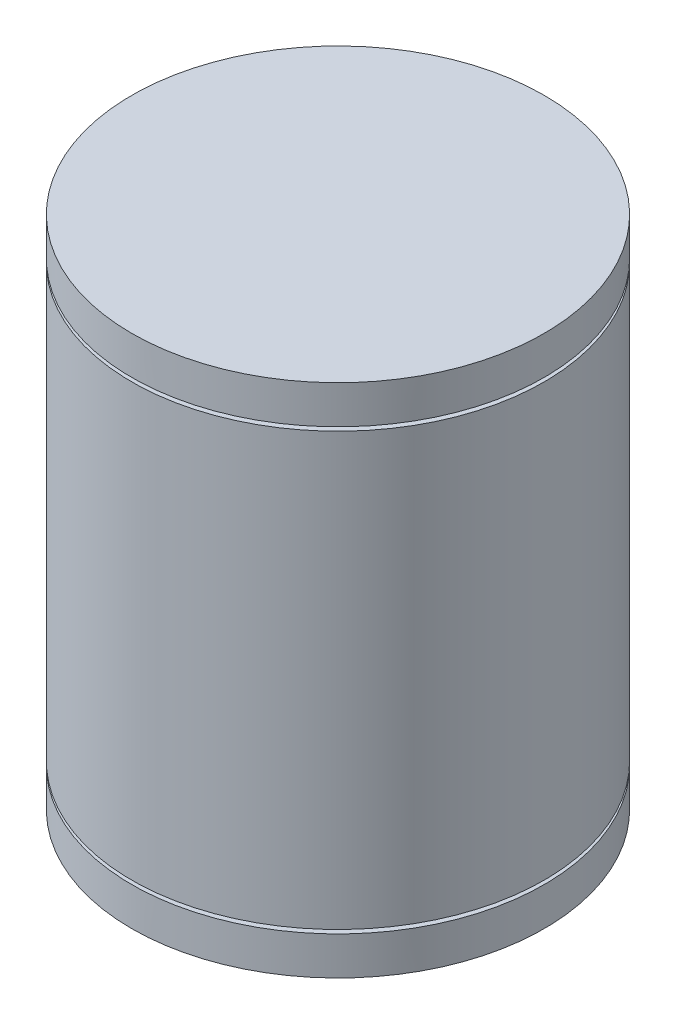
ISO-10303-21;
HEADER;
FILE_DESCRIPTION(('STEP AP214'),'2;1');
FILE_NAME('part.step','',(''),(''),'','','');
FILE_SCHEMA(('AUTOMOTIVE_DESIGN { 1 0 10303 214 1 1 1 1 }'));
ENDSEC;
DATA;
#1=APPLICATION_CONTEXT('core data for automotive mechanical design processes');
#2=APPLICATION_PROTOCOL_DEFINITION('international standard','automotive_design',2000,#1);
#3=PRODUCT_CONTEXT('',#1,'mechanical');
#4=PRODUCT('Part','Part','',(#3));
#5=PRODUCT_RELATED_PRODUCT_CATEGORY('part','',(#4));
#6=PRODUCT_DEFINITION_FORMATION('','',#4);
#7=PRODUCT_DEFINITION_CONTEXT('part definition',#1,'design');
#8=PRODUCT_DEFINITION('design','',#6,#7);
#9=PRODUCT_DEFINITION_SHAPE('','',#8);
#10=(LENGTH_UNIT() NAMED_UNIT(*) SI_UNIT(.MILLI.,.METRE.));
#11=(NAMED_UNIT(*) PLANE_ANGLE_UNIT() SI_UNIT($,.RADIAN.));
#12=(NAMED_UNIT(*) SI_UNIT($,.STERADIAN.) SOLID_ANGLE_UNIT());
#13=UNCERTAINTY_MEASURE_WITH_UNIT(LENGTH_MEASURE(1.E-05),#10,'distance_accuracy_value','');
#14=(GEOMETRIC_REPRESENTATION_CONTEXT(3) GLOBAL_UNCERTAINTY_ASSIGNED_CONTEXT((#13)) GLOBAL_UNIT_ASSIGNED_CONTEXT((#10,
#11,#12)) REPRESENTATION_CONTEXT('',''));
#15=CARTESIAN_POINT('',(0.,0.,0.));
#16=DIRECTION('',(0.,0.,1.));
#17=DIRECTION('',(1.,0.,0.));
#18=AXIS2_PLACEMENT_3D('',#15,#16,#17);
#19=CARTESIAN_POINT('',(0.,135.,0.));
#20=DIRECTION('',(0.,-1.,0.));
#21=DIRECTION('',(0.,0.,-1.));
#22=AXIS2_PLACEMENT_3D('',#19,#20,#21);
#23=CYLINDRICAL_SURFACE('',#22,54.);
#24=CARTESIAN_POINT('',(0.,11.,0.));
#25=DIRECTION('',(0.,-1.,0.));
#26=DIRECTION('',(0.,0.,-1.));
#27=AXIS2_PLACEMENT_3D('',#24,#25,#26);
#28=CIRCLE('',#27,54.);
#29=CARTESIAN_POINT('',(0.,11.,-54.));
#30=VERTEX_POINT('',#29);
#31=EDGE_CURVE('E58',#30,#30,#28,.T.);
#32=ORIENTED_EDGE('',*,*,#31,.F.);
#33=EDGE_LOOP('',(#32));
#34=FACE_BOUND('',#33,.T.);
#35=CARTESIAN_POINT('',(0.,124.,0.));
#36=DIRECTION('',(0.,-1.,0.));
#37=DIRECTION('',(0.,0.,-1.));
#38=AXIS2_PLACEMENT_3D('',#35,#36,#37);
#39=CIRCLE('',#38,54.);
#40=CARTESIAN_POINT('',(0.,124.,-54.));
#41=VERTEX_POINT('',#40);
#42=EDGE_CURVE('E74',#41,#41,#39,.T.);
#43=ORIENTED_EDGE('',*,*,#42,.T.);
#44=EDGE_LOOP('',(#43));
#45=FACE_BOUND('',#44,.T.);
#46=ADVANCED_FACE('F39',(#34,#45),#23,.T.);
#47=CARTESIAN_POINT('',(0.,10.,0.));
#48=DIRECTION('',(0.,-1.,0.));
#49=DIRECTION('',(0.,0.,-1.));
#50=AXIS2_PLACEMENT_3D('',#47,#48,#49);
#51=CIRCLE('',#50,54.);
#52=CARTESIAN_POINT('',(0.,10.,-54.));
#53=VERTEX_POINT('',#52);
#54=EDGE_CURVE('E62',#53,#53,#51,.T.);
#55=ORIENTED_EDGE('',*,*,#54,.T.);
#56=EDGE_LOOP('',(#55));
#57=FACE_BOUND('',#56,.T.);
#58=CARTESIAN_POINT('',(0.,0.,0.));
#59=DIRECTION('',(0.,1.,0.));
#60=DIRECTION('',(0.,0.,1.));
#61=AXIS2_PLACEMENT_3D('',#58,#59,#60);
#62=CIRCLE('',#61,54.);
#63=CARTESIAN_POINT('',(0.,0.,54.));
#64=VERTEX_POINT('',#63);
#65=EDGE_CURVE('E43',#64,#64,#62,.T.);
#66=ORIENTED_EDGE('',*,*,#65,.T.);
#67=EDGE_LOOP('',(#66));
#68=FACE_BOUND('',#67,.T.);
#69=ADVANCED_FACE('F41',(#57,#68),#23,.T.);
#70=CARTESIAN_POINT('',(0.,0.,0.));
#71=DIRECTION('',(0.,1.,0.));
#72=DIRECTION('',(0.,0.,1.));
#73=AXIS2_PLACEMENT_3D('',#70,#71,#72);
#74=PLANE('',#73);
#75=CARTESIAN_POINT('',(0.,0.,0.));
#76=DIRECTION('',(0.,-1.,0.));
#77=DIRECTION('',(0.,0.,-1.));
#78=AXIS2_PLACEMENT_3D('',#75,#76,#77);
#79=CIRCLE('',#78,46.);
#80=CARTESIAN_POINT('',(0.,0.,-46.));
#81=VERTEX_POINT('',#80);
#82=EDGE_CURVE('E54',#81,#81,#79,.T.);
#83=ORIENTED_EDGE('',*,*,#82,.F.);
#84=EDGE_LOOP('',(#83));
#85=FACE_BOUND('',#84,.T.);
#86=ORIENTED_EDGE('',*,*,#65,.F.);
#87=EDGE_LOOP('',(#86));
#88=FACE_BOUND('',#87,.T.);
#89=ADVANCED_FACE('F120',(#85,#88),#74,.F.);
#90=CARTESIAN_POINT('',(0.,10.,0.));
#91=DIRECTION('',(0.,-1.,0.));
#92=DIRECTION('',(0.,0.,-1.));
#93=AXIS2_PLACEMENT_3D('',#90,#91,#92);
#94=CYLINDRICAL_SURFACE('',#93,46.);
#95=CARTESIAN_POINT('',(0.,10.,0.));
#96=DIRECTION('',(0.,-1.,0.));
#97=DIRECTION('',(0.,0.,-1.));
#98=AXIS2_PLACEMENT_3D('',#95,#96,#97);
#99=CIRCLE('',#98,46.);
#100=CARTESIAN_POINT('',(0.,10.,-46.));
#101=VERTEX_POINT('',#100);
#102=EDGE_CURVE('E52',#101,#101,#99,.T.);
#103=ORIENTED_EDGE('',*,*,#102,.F.);
#104=EDGE_LOOP('',(#103));
#105=FACE_BOUND('',#104,.T.);
#106=ORIENTED_EDGE('',*,*,#82,.T.);
#107=EDGE_LOOP('',(#106));
#108=FACE_BOUND('',#107,.T.);
#109=ADVANCED_FACE('F135',(#105,#108),#94,.F.);
#110=CARTESIAN_POINT('',(0.,10.,0.));
#111=DIRECTION('',(0.,-1.,0.));
#112=DIRECTION('',(0.,0.,-1.));
#113=AXIS2_PLACEMENT_3D('',#110,#111,#112);
#114=PLANE('',#113);
#115=ORIENTED_EDGE('',*,*,#102,.T.);
#116=EDGE_LOOP('',(#115));
#117=FACE_BOUND('',#116,.T.);
#118=ADVANCED_FACE('F142',(#117),#114,.T.);
#119=CARTESIAN_POINT('',(0.,11.,0.));
#120=DIRECTION('',(0.,-1.,0.));
#121=DIRECTION('',(0.,0.,-1.));
#122=AXIS2_PLACEMENT_3D('',#119,#120,#121);
#123=PLANE('',#122);
#124=CARTESIAN_POINT('',(0.,11.,0.));
#125=DIRECTION('',(0.,-1.,0.));
#126=DIRECTION('',(0.,0.,-1.));
#127=AXIS2_PLACEMENT_3D('',#124,#125,#126);
#128=CIRCLE('',#127,52.);
#129=CARTESIAN_POINT('',(0.,11.,-52.));
#130=VERTEX_POINT('',#129);
#131=EDGE_CURVE('E66',#130,#130,#128,.T.);
#132=ORIENTED_EDGE('',*,*,#131,.F.);
#133=EDGE_LOOP('',(#132));
#134=FACE_BOUND('',#133,.T.);
#135=ORIENTED_EDGE('',*,*,#31,.T.);
#136=EDGE_LOOP('',(#135));
#137=FACE_BOUND('',#136,.T.);
#138=ADVANCED_FACE('F152',(#134,#137),#123,.T.);
#139=CARTESIAN_POINT('',(0.,10.,0.));
#140=DIRECTION('',(0.,-1.,0.));
#141=DIRECTION('',(0.,0.,-1.));
#142=AXIS2_PLACEMENT_3D('',#139,#140,#141);
#143=PLANE('',#142);
#144=CARTESIAN_POINT('',(0.,10.,0.));
#145=DIRECTION('',(0.,-1.,0.));
#146=DIRECTION('',(0.,0.,-1.));
#147=AXIS2_PLACEMENT_3D('',#144,#145,#146);
#148=CIRCLE('',#147,52.);
#149=CARTESIAN_POINT('',(0.,10.,-52.));
#150=VERTEX_POINT('',#149);
#151=EDGE_CURVE('E70',#150,#150,#148,.T.);
#152=ORIENTED_EDGE('',*,*,#151,.T.);
#153=EDGE_LOOP('',(#152));
#154=FACE_BOUND('',#153,.T.);
#155=ORIENTED_EDGE('',*,*,#54,.F.);
#156=EDGE_LOOP('',(#155));
#157=FACE_BOUND('',#156,.T.);
#158=ADVANCED_FACE('F158',(#154,#157),#143,.F.);
#159=CARTESIAN_POINT('',(0.,11.,0.));
#160=DIRECTION('',(0.,-1.,0.));
#161=DIRECTION('',(0.,0.,-1.));
#162=AXIS2_PLACEMENT_3D('',#159,#160,#161);
#163=CYLINDRICAL_SURFACE('',#162,52.);
#164=ORIENTED_EDGE('',*,*,#131,.T.);
#165=EDGE_LOOP('',(#164));
#166=FACE_BOUND('',#165,.T.);
#167=ORIENTED_EDGE('',*,*,#151,.F.);
#168=EDGE_LOOP('',(#167));
#169=FACE_BOUND('',#168,.T.);
#170=ADVANCED_FACE('F110',(#166,#169),#163,.T.);
#171=CARTESIAN_POINT('',(0.,124.,0.));
#172=DIRECTION('',(0.,1.,0.));
#173=DIRECTION('',(0.,0.,-1.));
#174=AXIS2_PLACEMENT_3D('',#171,#172,#173);
#175=PLANE('',#174);
#176=ORIENTED_EDGE('',*,*,#42,.F.);
#177=EDGE_LOOP('',(#176));
#178=FACE_BOUND('',#177,.T.);
#179=CARTESIAN_POINT('',(0.,124.,0.));
#180=DIRECTION('',(0.,-1.,0.));
#181=DIRECTION('',(0.,0.,-1.));
#182=AXIS2_PLACEMENT_3D('',#179,#180,#181);
#183=CIRCLE('',#182,52.);
#184=CARTESIAN_POINT('',(0.,124.,-52.));
#185=VERTEX_POINT('',#184);
#186=EDGE_CURVE('E82',#185,#185,#183,.T.);
#187=ORIENTED_EDGE('',*,*,#186,.T.);
#188=EDGE_LOOP('',(#187));
#189=FACE_BOUND('',#188,.T.);
#190=ADVANCED_FACE('F94',(#178,#189),#175,.T.);
#191=CARTESIAN_POINT('',(0.,125.,0.));
#192=DIRECTION('',(0.,1.,0.));
#193=DIRECTION('',(0.,0.,-1.));
#194=AXIS2_PLACEMENT_3D('',#191,#192,#193);
#195=PLANE('',#194);
#196=CARTESIAN_POINT('',(0.,125.,0.));
#197=DIRECTION('',(0.,-1.,0.));
#198=DIRECTION('',(0.,0.,-1.));
#199=AXIS2_PLACEMENT_3D('',#196,#197,#198);
#200=CIRCLE('',#199,54.);
#201=CARTESIAN_POINT('',(0.,125.,-54.));
#202=VERTEX_POINT('',#201);
#203=EDGE_CURVE('E78',#202,#202,#200,.T.);
#204=ORIENTED_EDGE('',*,*,#203,.T.);
#205=EDGE_LOOP('',(#204));
#206=FACE_BOUND('',#205,.T.);
#207=CARTESIAN_POINT('',(0.,125.,0.));
#208=DIRECTION('',(0.,-1.,0.));
#209=DIRECTION('',(0.,0.,-1.));
#210=AXIS2_PLACEMENT_3D('',#207,#208,#209);
#211=CIRCLE('',#210,52.);
#212=CARTESIAN_POINT('',(0.,125.,-52.));
#213=VERTEX_POINT('',#212);
#214=EDGE_CURVE('E86',#213,#213,#211,.T.);
#215=ORIENTED_EDGE('',*,*,#214,.F.);
#216=EDGE_LOOP('',(#215));
#217=FACE_BOUND('',#216,.T.);
#218=ADVANCED_FACE('F100',(#206,#217),#195,.F.);
#219=CARTESIAN_POINT('',(0.,124.,0.));
#220=DIRECTION('',(0.,1.,0.));
#221=DIRECTION('',(0.,0.,1.));
#222=AXIS2_PLACEMENT_3D('',#219,#220,#221);
#223=CYLINDRICAL_SURFACE('',#222,52.);
#224=ORIENTED_EDGE('',*,*,#186,.F.);
#225=EDGE_LOOP('',(#224));
#226=FACE_BOUND('',#225,.T.);
#227=ORIENTED_EDGE('',*,*,#214,.T.);
#228=EDGE_LOOP('',(#227));
#229=FACE_BOUND('',#228,.T.);
#230=ADVANCED_FACE('F96',(#226,#229),#223,.T.);
#231=CARTESIAN_POINT('',(0.,135.,0.));
#232=DIRECTION('',(0.,1.,0.));
#233=DIRECTION('',(0.,0.,1.));
#234=AXIS2_PLACEMENT_3D('',#231,#232,#233);
#235=PLANE('',#234);
#236=CARTESIAN_POINT('',(0.,135.,0.));
#237=DIRECTION('',(0.,1.,0.));
#238=DIRECTION('',(0.,0.,1.));
#239=AXIS2_PLACEMENT_3D('',#236,#237,#238);
#240=CIRCLE('',#239,54.);
#241=CARTESIAN_POINT('',(0.,135.,54.));
#242=VERTEX_POINT('',#241);
#243=EDGE_CURVE('E10',#242,#242,#240,.T.);
#244=ORIENTED_EDGE('',*,*,#243,.T.);
#245=EDGE_LOOP('',(#244));
#246=FACE_BOUND('',#245,.T.);
#247=ADVANCED_FACE('F99',(#246),#235,.T.);
#248=ORIENTED_EDGE('',*,*,#203,.F.);
#249=EDGE_LOOP('',(#248));
#250=FACE_BOUND('',#249,.T.);
#251=ORIENTED_EDGE('',*,*,#243,.F.);
#252=EDGE_LOOP('',(#251));
#253=FACE_BOUND('',#252,.T.);
#254=ADVANCED_FACE('F116',(#250,#253),#23,.T.);
#255=CLOSED_SHELL('',(#46,#69,#89,#109,#118,#138,#158,#170,#190,#218,#230,#247,#254));
#256=MANIFOLD_SOLID_BREP('B2',#255);
#257=ADVANCED_BREP_SHAPE_REPRESENTATION('',(#18,#256),#14);
#258=SHAPE_DEFINITION_REPRESENTATION(#9,#257);
ENDSEC;
END-ISO-10303-21;
